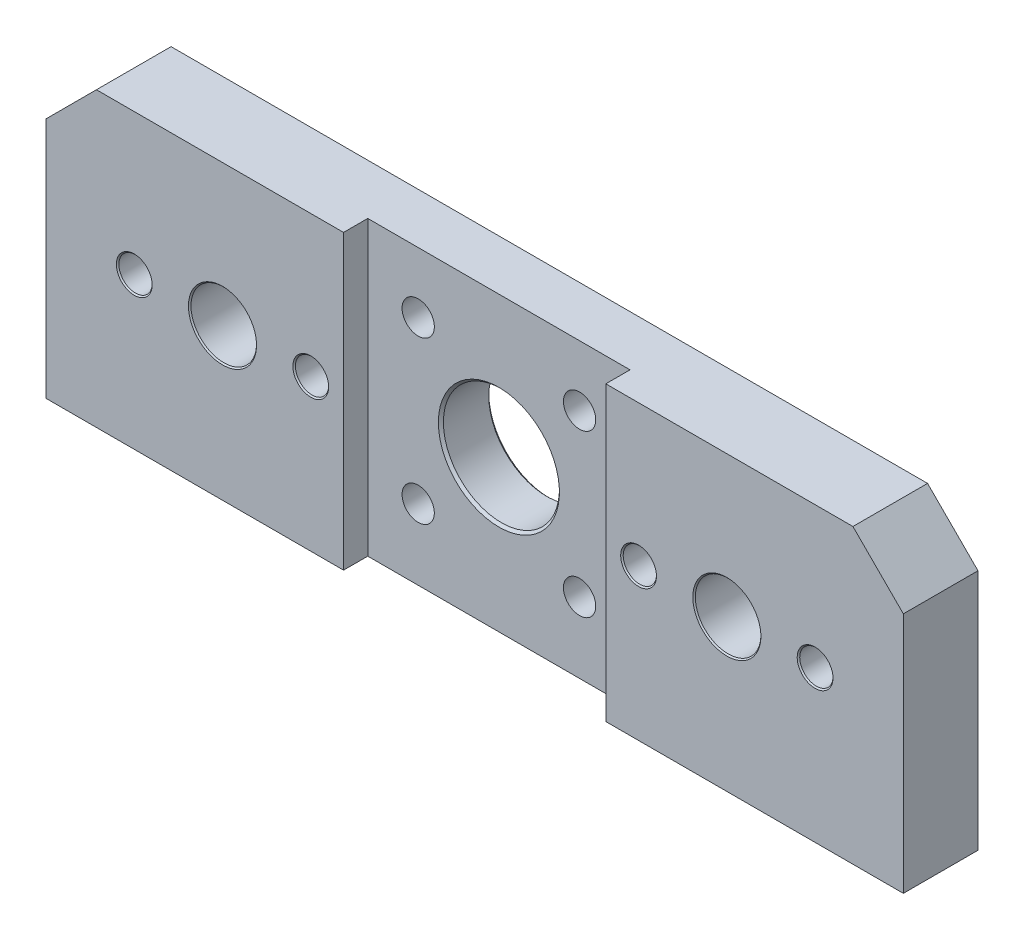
from build123d import *

# Parameters (mm, degrees)
ESQUISSE1_W                                     = 170
ESQUISSE1_H                                     = 58
EXTRUSION1_DEPTH                                = 14.8
CHANFREIN1_SIZE                                 = 10
ESQUISSE2_W                                     = 52
ESQUISSE2_H                                     = 84.086461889
ENL_V_MAT_EXTRU_1_DEPTH                         = 4.8
ESQUISSE3_R                                     = 11.5
ESQUISSE3_R_2                                   = 6.5
ENL_V_MAT_EXTRU_2_DEPTH                         = 104.961723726
CHAMBRAGE_POUR_VIS_T_TE_CYLINDRIQUE_D           = 6.6
CHAMBRAGE_POUR_VIS_T_TE_CYLINDRIQUE_CBORE_D     = 12
CHAMBRAGE_POUR_VIS_T_TE_CYLINDRIQUE_CBORE_DEPTH = 7
CHANFREIN2_SIZE                                 = 0.5
CHANFREIN3_SIZE                                 = 0.25
TROU_TARAUD_M61_D                               = 4.8
TROU_TARAUD_M61_DEPTH                           = 22
TROU_TARAUD_M61_TIP                             = 1.442065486
D_GAGEMENT_M62_D                                = 6.4
D_GAGEMENT_M62_DEPTH                            = 10
D_GAGEMENT_M62_TIP                              = 1.922753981


with BuildPart() as part:
    # Esquisse1 → Extrusion1 (new body)
    with BuildSketch(Plane.XY):
        with Locations((0, 29)):
            Rectangle(ESQUISSE1_W, ESQUISSE1_H)
    extrude(amount=EXTRUSION1_DEPTH)

    # Chanfrein1
    chanfrein1_edges = [part.edges().sort_by_distance(p)[0] for p in [
        (-85, 58, 7.4),
        (85, 58, 7.4),
    ]]
    chamfer(chanfrein1_edges, length=CHANFREIN1_SIZE)

    # Esquisse2 → Enl_v. mat.-Extru.1 (cut)
    with BuildSketch(Plane.XY.offset(14.8)):
        with Locations((0, 42.043230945)):
            Rectangle(ESQUISSE2_W, ESQUISSE2_H)
    extrude(amount=-ENL_V_MAT_EXTRU_1_DEPTH, mode=Mode.SUBTRACT)

    # Esquisse3 → Enl_v. mat.-Extru.2 (cut, through all)
    with BuildSketch(Plane.XY.offset(14.8)):
        with Locations((0, 30)):
            Circle(ESQUISSE3_R)
        with Locations((-50, 30)):
            Circle(ESQUISSE3_R_2)
        with Locations((50, 30)):
            Circle(ESQUISSE3_R_2)
    extrude(amount=-ENL_V_MAT_EXTRU_2_DEPTH, mode=Mode.SUBTRACT)

    # Chambrage pour vis _ t_te cylindrique (through all)
    with Locations(Plane(origin=(0, 0, 0), x_dir=(-1, 0, 0), z_dir=(0, 0, -1))):
        with Locations((-32.5, 30), (-67.5, 30), (32.5, 30), (67.5, 30)):
            CounterBoreHole(CHAMBRAGE_POUR_VIS_T_TE_CYLINDRIQUE_D / 2, CHAMBRAGE_POUR_VIS_T_TE_CYLINDRIQUE_CBORE_D / 2, CHAMBRAGE_POUR_VIS_T_TE_CYLINDRIQUE_CBORE_DEPTH)

    # Chanfrein2
    chanfrein2_edges = [part.edges().sort_by_distance(p)[0] for p in [
        (-11.5, 30, 0),
        (-11.5, 30, 10),
    ]]
    chamfer(chanfrein2_edges, length=CHANFREIN2_SIZE)

    # Chanfrein3
    chanfrein3_edges = [part.edges().sort_by_distance(p)[0] for p in [
        (-56.5, 30, 0),
        (-56.5, 30, 14.8),
        (43.5, 30, 0),
        (43.5, 30, 14.8),
        (-61.5, 30, 0),
        (-70.8, 30, 14.8),
        (-26.5, 30, 0),
        (-35.8, 30, 14.8),
        (73.5, 30, 0),
        (64.2, 30, 14.8),
        (38.5, 30, 0),
        (29.2, 30, 14.8),
    ]]
    chamfer(chanfrein3_edges, length=CHANFREIN3_SIZE)

    # Trou taraud_ M61
    with Locations(Plane.XZ):
        with Locations((73, 7.5), (-73, 7.5)):
            Hole(TROU_TARAUD_M61_D / 2, depth=TROU_TARAUD_M61_DEPTH)
            with Locations((0, 0, -(TROU_TARAUD_M61_DEPTH + TROU_TARAUD_M61_TIP / 2))):  # 118° drill point
                Cone(0, TROU_TARAUD_M61_D / 2, TROU_TARAUD_M61_TIP, mode=Mode.SUBTRACT)

    # D_gagement M62
    with Locations(Plane.XY.offset(10)):
        with Locations((16, 46), (16, 14), (-16, 46), (-16, 14)):
            Hole(D_GAGEMENT_M62_D / 2, depth=D_GAGEMENT_M62_DEPTH)
            with Locations((0, 0, -(D_GAGEMENT_M62_DEPTH + D_GAGEMENT_M62_TIP / 2))):  # 118° drill point
                Cone(0, D_GAGEMENT_M62_D / 2, D_GAGEMENT_M62_TIP, mode=Mode.SUBTRACT)


solid = part.part
